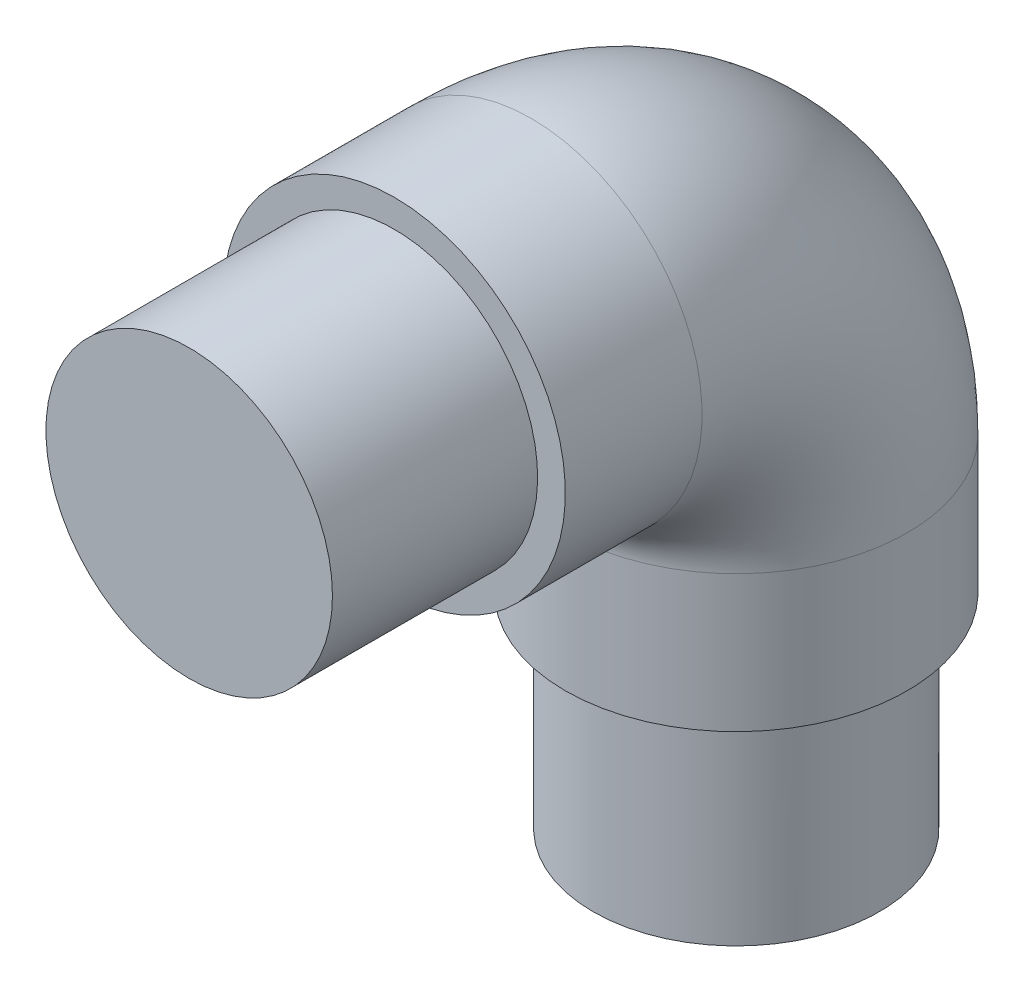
from build123d import *

# Parameters (mm, degrees)
SKETCH_1_R        = 10.475
EXTRUDE_1_DEPTH   = 15
SWEEP_3_PROFILE_R = 12.5
SKETCH_70_R       = 10.475
EXTRUDE_2_DEPTH   = 15


with BuildPart() as part:
    # Sketch 1 → Extrude 1 (new body)
    with BuildSketch(Plane.XY):
        Circle(SKETCH_1_R)
    extrude(amount=EXTRUDE_1_DEPTH)

    # Sweep 3: sweep along a path in Sketch 2
    with BuildLine(Plane(origin=(0, 0, 0), x_dir=(0, 0, -1), z_dir=(1, 0, 0))) as sweep_3_path:
        Line((0, 0), (10, 0))
        ThreePointArc((10, 0), (20.606601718, -4.393398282), (25, -15))
        Line((25, -15), (25, -25))
    # Sweep 3 profile (on start of the path) → Sweep 3 (sweep)
    with BuildSketch(Plane(origin=(0, 0, 0), x_dir=(-1, 0, 0), z_dir=(0, 0, -1))):
        Circle(SWEEP_3_PROFILE_R)
    sweep(path=sweep_3_path.line)

    # Sketch 70 → Extrude 2 (add)
    with BuildSketch(Plane.XZ.offset(25)):
        with Locations(Location((0, -25, 0), (0, 0, 90))):
            Circle(SKETCH_70_R)
    extrude(amount=EXTRUDE_2_DEPTH)


solid = part.part
